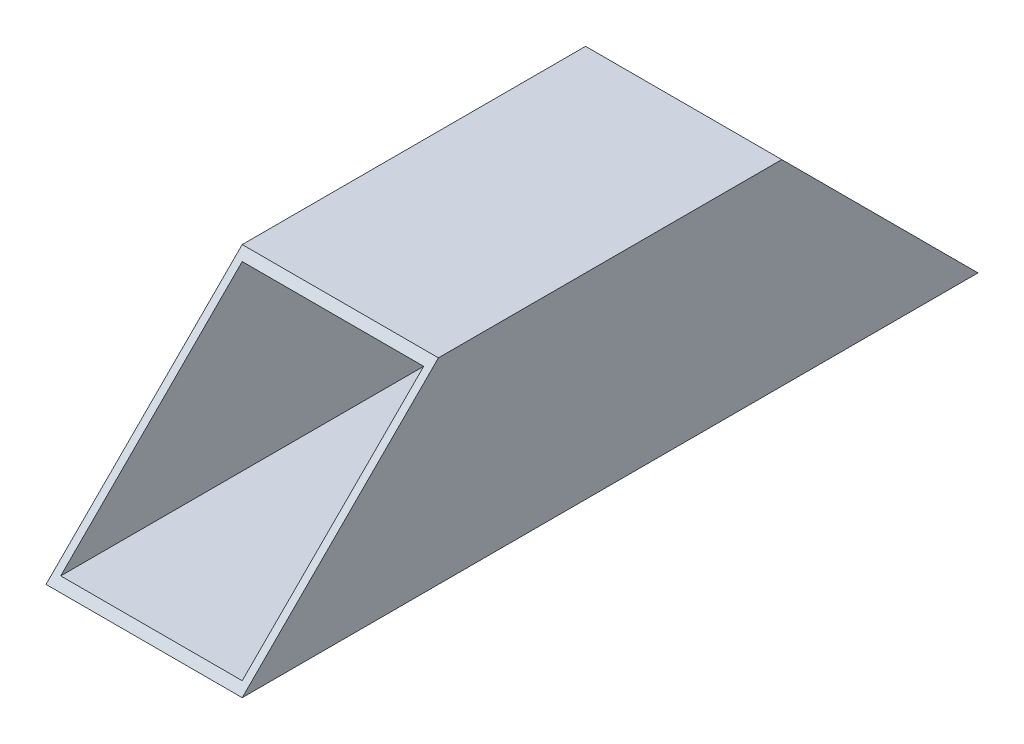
ISO-10303-21;
HEADER;
FILE_DESCRIPTION(('STEP AP214'),'2;1');
FILE_NAME('part.step','',(''),(''),'','','');
FILE_SCHEMA(('AUTOMOTIVE_DESIGN { 1 0 10303 214 1 1 1 1 }'));
ENDSEC;
DATA;
#1=APPLICATION_CONTEXT('core data for automotive mechanical design processes');
#2=APPLICATION_PROTOCOL_DEFINITION('international standard','automotive_design',2000,#1);
#3=PRODUCT_CONTEXT('',#1,'mechanical');
#4=PRODUCT('Part','Part','',(#3));
#5=PRODUCT_RELATED_PRODUCT_CATEGORY('part','',(#4));
#6=PRODUCT_DEFINITION_FORMATION('','',#4);
#7=PRODUCT_DEFINITION_CONTEXT('part definition',#1,'design');
#8=PRODUCT_DEFINITION('design','',#6,#7);
#9=PRODUCT_DEFINITION_SHAPE('','',#8);
#10=(LENGTH_UNIT() NAMED_UNIT(*) SI_UNIT(.MILLI.,.METRE.));
#11=(NAMED_UNIT(*) PLANE_ANGLE_UNIT() SI_UNIT($,.RADIAN.));
#12=(NAMED_UNIT(*) SI_UNIT($,.STERADIAN.) SOLID_ANGLE_UNIT());
#13=UNCERTAINTY_MEASURE_WITH_UNIT(LENGTH_MEASURE(1.E-05),#10,'distance_accuracy_value','');
#14=(GEOMETRIC_REPRESENTATION_CONTEXT(3) GLOBAL_UNCERTAINTY_ASSIGNED_CONTEXT((#13)) GLOBAL_UNIT_ASSIGNED_CONTEXT((#10,
#11,#12)) REPRESENTATION_CONTEXT('',''));
#15=CARTESIAN_POINT('',(0.,0.,0.));
#16=DIRECTION('',(0.,0.,1.));
#17=DIRECTION('',(1.,0.,0.));
#18=AXIS2_PLACEMENT_3D('',#15,#16,#17);
#19=CARTESIAN_POINT('',(0.,80.,300.));
#20=DIRECTION('',(1.,0.,0.));
#21=DIRECTION('',(0.,1.,0.));
#22=AXIS2_PLACEMENT_3D('',#19,#20,#21);
#23=PLANE('',#22);
#24=DIRECTION('',(0.,0.,-1.));
#25=VECTOR('',#24,1.);
#26=CARTESIAN_POINT('',(0.,80.,300.));
#27=LINE('',#26,#25);
#28=CARTESIAN_POINT('',(0.,80.,220.));
#29=VERTEX_POINT('',#28);
#30=CARTESIAN_POINT('',(0.,80.,80.0000000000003));
#31=VERTEX_POINT('',#30);
#32=EDGE_CURVE('E123',#29,#31,#27,.T.);
#33=ORIENTED_EDGE('',*,*,#32,.T.);
#34=DIRECTION('',(0.,0.707106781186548,0.707106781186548));
#35=VECTOR('',#34,1.);
#36=CARTESIAN_POINT('',(0.,80.,80.0000000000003));
#37=LINE('',#36,#35);
#38=CARTESIAN_POINT('',(0.,0.,0.));
#39=VERTEX_POINT('',#38);
#40=EDGE_CURVE('E42',#31,#39,#37,.F.);
#41=ORIENTED_EDGE('',*,*,#40,.T.);
#42=DIRECTION('',(0.,0.,-1.));
#43=VECTOR('',#42,1.);
#44=CARTESIAN_POINT('',(0.,0.,300.));
#45=LINE('',#44,#43);
#46=CARTESIAN_POINT('',(0.,0.,300.));
#47=VERTEX_POINT('',#46);
#48=EDGE_CURVE('E130',#47,#39,#45,.T.);
#49=ORIENTED_EDGE('',*,*,#48,.F.);
#50=DIRECTION('',(0.,0.707106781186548,-0.707106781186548));
#51=VECTOR('',#50,1.);
#52=CARTESIAN_POINT('',(0.,-2.35922392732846E-13,300.));
#53=LINE('',#52,#51);
#54=EDGE_CURVE('E133',#47,#29,#53,.T.);
#55=ORIENTED_EDGE('',*,*,#54,.T.);
#56=EDGE_LOOP('',(#33,#41,#49,#55));
#57=FACE_BOUND('',#56,.T.);
#58=ADVANCED_FACE('F32',(#57),#23,.F.);
#59=CARTESIAN_POINT('',(0.,0.,300.));
#60=DIRECTION('',(0.,1.,0.));
#61=DIRECTION('',(0.,0.,1.));
#62=AXIS2_PLACEMENT_3D('',#59,#60,#61);
#63=PLANE('',#62);
#64=DIRECTION('',(1.,0.,0.));
#65=VECTOR('',#64,1.);
#66=CARTESIAN_POINT('',(0.,0.,0.));
#67=LINE('',#66,#65);
#68=CARTESIAN_POINT('',(80.,0.,0.));
#69=VERTEX_POINT('',#68);
#70=EDGE_CURVE('E90',#39,#69,#67,.T.);
#71=ORIENTED_EDGE('',*,*,#70,.T.);
#72=DIRECTION('',(0.,0.,-1.));
#73=VECTOR('',#72,1.);
#74=CARTESIAN_POINT('',(80.,0.,300.));
#75=LINE('',#74,#73);
#76=CARTESIAN_POINT('',(80.,0.,300.));
#77=VERTEX_POINT('',#76);
#78=EDGE_CURVE('E128',#77,#69,#75,.T.);
#79=ORIENTED_EDGE('',*,*,#78,.F.);
#80=DIRECTION('',(1.,0.,0.));
#81=VECTOR('',#80,1.);
#82=CARTESIAN_POINT('',(0.,0.,300.));
#83=LINE('',#82,#81);
#84=EDGE_CURVE('E120',#47,#77,#83,.T.);
#85=ORIENTED_EDGE('',*,*,#84,.F.);
#86=ORIENTED_EDGE('',*,*,#48,.T.);
#87=EDGE_LOOP('',(#71,#79,#85,#86));
#88=FACE_BOUND('',#87,.T.);
#89=ADVANCED_FACE('F161',(#88),#63,.F.);
#90=CARTESIAN_POINT('',(80.,80.,300.));
#91=DIRECTION('',(-1.,0.,0.));
#92=DIRECTION('',(0.,-1.,0.));
#93=AXIS2_PLACEMENT_3D('',#90,#91,#92);
#94=PLANE('',#93);
#95=ORIENTED_EDGE('',*,*,#78,.T.);
#96=DIRECTION('',(0.,-0.707106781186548,-0.707106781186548));
#97=VECTOR('',#96,1.);
#98=CARTESIAN_POINT('',(80.,80.,80.0000000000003));
#99=LINE('',#98,#97);
#100=CARTESIAN_POINT('',(80.,80.,80.0000000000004));
#101=VERTEX_POINT('',#100);
#102=EDGE_CURVE('E11',#69,#101,#99,.F.);
#103=ORIENTED_EDGE('',*,*,#102,.T.);
#104=DIRECTION('',(0.,0.,-1.));
#105=VECTOR('',#104,1.);
#106=CARTESIAN_POINT('',(80.,80.,300.));
#107=LINE('',#106,#105);
#108=CARTESIAN_POINT('',(80.,80.,220.));
#109=VERTEX_POINT('',#108);
#110=EDGE_CURVE('E126',#109,#101,#107,.T.);
#111=ORIENTED_EDGE('',*,*,#110,.F.);
#112=DIRECTION('',(0.,-0.707106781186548,0.707106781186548));
#113=VECTOR('',#112,1.);
#114=CARTESIAN_POINT('',(80.,-2.42861286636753E-13,300.));
#115=LINE('',#114,#113);
#116=EDGE_CURVE('E139',#109,#77,#115,.T.);
#117=ORIENTED_EDGE('',*,*,#116,.T.);
#118=EDGE_LOOP('',(#95,#103,#111,#117));
#119=FACE_BOUND('',#118,.T.);
#120=ADVANCED_FACE('F188',(#119),#94,.F.);
#121=CARTESIAN_POINT('',(0.,80.,300.));
#122=DIRECTION('',(0.,-1.,0.));
#123=DIRECTION('',(0.,0.,-1.));
#124=AXIS2_PLACEMENT_3D('',#121,#122,#123);
#125=PLANE('',#124);
#126=ORIENTED_EDGE('',*,*,#110,.T.);
#127=DIRECTION('',(-1.,0.,0.));
#128=VECTOR('',#127,1.);
#129=CARTESIAN_POINT('',(0.,80.,80.0000000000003));
#130=LINE('',#129,#128);
#131=EDGE_CURVE('E142',#101,#31,#130,.T.);
#132=ORIENTED_EDGE('',*,*,#131,.T.);
#133=ORIENTED_EDGE('',*,*,#32,.F.);
#134=DIRECTION('',(1.,0.,0.));
#135=VECTOR('',#134,1.);
#136=CARTESIAN_POINT('',(80.,80.,220.));
#137=LINE('',#136,#135);
#138=EDGE_CURVE('E136',#29,#109,#137,.T.);
#139=ORIENTED_EDGE('',*,*,#138,.T.);
#140=EDGE_LOOP('',(#126,#132,#133,#139));
#141=FACE_BOUND('',#140,.T.);
#142=ADVANCED_FACE('F193',(#141),#125,.F.);
#143=CARTESIAN_POINT('',(3.,77.,300.));
#144=DIRECTION('',(1.,0.,0.));
#145=DIRECTION('',(0.,1.,0.));
#146=AXIS2_PLACEMENT_3D('',#143,#144,#145);
#147=PLANE('',#146);
#148=DIRECTION('',(0.,0.707106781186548,0.707106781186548));
#149=VECTOR('',#148,1.);
#150=CARTESIAN_POINT('',(2.99999999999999,80.,80.0000000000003));
#151=LINE('',#150,#149);
#152=CARTESIAN_POINT('',(3.,77.,77.0000000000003));
#153=VERTEX_POINT('',#152);
#154=CARTESIAN_POINT('',(3.,3.,3.00000000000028));
#155=VERTEX_POINT('',#154);
#156=EDGE_CURVE('E82',#153,#155,#151,.F.);
#157=ORIENTED_EDGE('',*,*,#156,.F.);
#158=DIRECTION('',(0.,0.,-1.));
#159=VECTOR('',#158,1.);
#160=CARTESIAN_POINT('',(3.,77.,300.));
#161=LINE('',#160,#159);
#162=CARTESIAN_POINT('',(3.,77.,223.));
#163=VERTEX_POINT('',#162);
#164=EDGE_CURVE('E109',#163,#153,#161,.T.);
#165=ORIENTED_EDGE('',*,*,#164,.F.);
#166=DIRECTION('',(0.,-0.707106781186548,0.707106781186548));
#167=VECTOR('',#166,1.);
#168=CARTESIAN_POINT('',(3.,38.4999999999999,261.5));
#169=LINE('',#168,#167);
#170=CARTESIAN_POINT('',(3.,3.,297.));
#171=VERTEX_POINT('',#170);
#172=EDGE_CURVE('E89',#163,#171,#169,.T.);
#173=ORIENTED_EDGE('',*,*,#172,.T.);
#174=DIRECTION('',(0.,0.,-1.));
#175=VECTOR('',#174,1.);
#176=CARTESIAN_POINT('',(3.,3.,300.));
#177=LINE('',#176,#175);
#178=EDGE_CURVE('E76',#171,#155,#177,.T.);
#179=ORIENTED_EDGE('',*,*,#178,.T.);
#180=EDGE_LOOP('',(#157,#165,#173,#179));
#181=FACE_BOUND('',#180,.T.);
#182=ADVANCED_FACE('F85',(#181),#147,.T.);
#183=CARTESIAN_POINT('',(3.,3.,300.));
#184=DIRECTION('',(0.,1.,0.));
#185=DIRECTION('',(0.,0.,1.));
#186=AXIS2_PLACEMENT_3D('',#183,#184,#185);
#187=PLANE('',#186);
#188=DIRECTION('',(-1.,0.,0.));
#189=VECTOR('',#188,1.);
#190=CARTESIAN_POINT('',(0.,3.,3.00000000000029));
#191=LINE('',#190,#189);
#192=CARTESIAN_POINT('',(77.,3.,3.00000000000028));
#193=VERTEX_POINT('',#192);
#194=EDGE_CURVE('E36',#155,#193,#191,.F.);
#195=ORIENTED_EDGE('',*,*,#194,.F.);
#196=ORIENTED_EDGE('',*,*,#178,.F.);
#197=DIRECTION('',(1.,0.,0.));
#198=VECTOR('',#197,1.);
#199=CARTESIAN_POINT('',(3.,3.,297.));
#200=LINE('',#199,#198);
#201=CARTESIAN_POINT('',(77.,3.,297.));
#202=VERTEX_POINT('',#201);
#203=EDGE_CURVE('E143',#171,#202,#200,.T.);
#204=ORIENTED_EDGE('',*,*,#203,.T.);
#205=DIRECTION('',(0.,0.,-1.));
#206=VECTOR('',#205,1.);
#207=CARTESIAN_POINT('',(77.,3.,300.));
#208=LINE('',#207,#206);
#209=EDGE_CURVE('E70',#202,#193,#208,.T.);
#210=ORIENTED_EDGE('',*,*,#209,.T.);
#211=EDGE_LOOP('',(#195,#196,#204,#210));
#212=FACE_BOUND('',#211,.T.);
#213=ADVANCED_FACE('F75',(#212),#187,.T.);
#214=CARTESIAN_POINT('',(77.,77.,300.));
#215=DIRECTION('',(-1.,0.,0.));
#216=DIRECTION('',(0.,-1.,0.));
#217=AXIS2_PLACEMENT_3D('',#214,#215,#216);
#218=PLANE('',#217);
#219=DIRECTION('',(0.,-0.707106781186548,-0.707106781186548));
#220=VECTOR('',#219,1.);
#221=CARTESIAN_POINT('',(77.,80.,80.0000000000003));
#222=LINE('',#221,#220);
#223=CARTESIAN_POINT('',(77.,77.,77.0000000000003));
#224=VERTEX_POINT('',#223);
#225=EDGE_CURVE('E81',#193,#224,#222,.F.);
#226=ORIENTED_EDGE('',*,*,#225,.F.);
#227=ORIENTED_EDGE('',*,*,#209,.F.);
#228=DIRECTION('',(0.,0.707106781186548,-0.707106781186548));
#229=VECTOR('',#228,1.);
#230=CARTESIAN_POINT('',(77.,38.4999999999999,261.5));
#231=LINE('',#230,#229);
#232=CARTESIAN_POINT('',(77.,77.,223.));
#233=VERTEX_POINT('',#232);
#234=EDGE_CURVE('E105',#202,#233,#231,.T.);
#235=ORIENTED_EDGE('',*,*,#234,.T.);
#236=DIRECTION('',(0.,0.,-1.));
#237=VECTOR('',#236,1.);
#238=CARTESIAN_POINT('',(77.,77.,300.));
#239=LINE('',#238,#237);
#240=EDGE_CURVE('E104',#233,#224,#239,.T.);
#241=ORIENTED_EDGE('',*,*,#240,.T.);
#242=EDGE_LOOP('',(#226,#227,#235,#241));
#243=FACE_BOUND('',#242,.T.);
#244=ADVANCED_FACE('F99',(#243),#218,.T.);
#245=CARTESIAN_POINT('',(3.,77.,300.));
#246=DIRECTION('',(0.,-1.,0.));
#247=DIRECTION('',(0.,0.,-1.));
#248=AXIS2_PLACEMENT_3D('',#245,#246,#247);
#249=PLANE('',#248);
#250=DIRECTION('',(1.,0.,0.));
#251=VECTOR('',#250,1.);
#252=CARTESIAN_POINT('',(0.,77.,77.0000000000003));
#253=LINE('',#252,#251);
#254=EDGE_CURVE('E94',#224,#153,#253,.F.);
#255=ORIENTED_EDGE('',*,*,#254,.F.);
#256=ORIENTED_EDGE('',*,*,#240,.F.);
#257=DIRECTION('',(-1.,0.,0.));
#258=VECTOR('',#257,1.);
#259=CARTESIAN_POINT('',(3.,77.,223.));
#260=LINE('',#259,#258);
#261=EDGE_CURVE('E113',#233,#163,#260,.T.);
#262=ORIENTED_EDGE('',*,*,#261,.T.);
#263=ORIENTED_EDGE('',*,*,#164,.T.);
#264=EDGE_LOOP('',(#255,#256,#262,#263));
#265=FACE_BOUND('',#264,.T.);
#266=ADVANCED_FACE('F111',(#265),#249,.T.);
#267=CARTESIAN_POINT('',(0.,-2.35922392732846E-13,300.));
#268=DIRECTION('',(0.,0.707106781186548,0.707106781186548));
#269=DIRECTION('',(0.,-0.707106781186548,0.707106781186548));
#270=AXIS2_PLACEMENT_3D('',#267,#268,#269);
#271=PLANE('',#270);
#272=ORIENTED_EDGE('',*,*,#116,.F.);
#273=ORIENTED_EDGE('',*,*,#138,.F.);
#274=ORIENTED_EDGE('',*,*,#54,.F.);
#275=ORIENTED_EDGE('',*,*,#84,.T.);
#276=EDGE_LOOP('',(#272,#273,#274,#275));
#277=FACE_BOUND('',#276,.T.);
#278=ORIENTED_EDGE('',*,*,#203,.F.);
#279=ORIENTED_EDGE('',*,*,#172,.F.);
#280=ORIENTED_EDGE('',*,*,#261,.F.);
#281=ORIENTED_EDGE('',*,*,#234,.F.);
#282=EDGE_LOOP('',(#278,#279,#280,#281));
#283=FACE_BOUND('',#282,.T.);
#284=ADVANCED_FACE('F174',(#277,#283),#271,.T.);
#285=CARTESIAN_POINT('',(0.,80.,80.0000000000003));
#286=DIRECTION('',(0.,-0.707106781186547,0.707106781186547));
#287=DIRECTION('',(0.,-0.707106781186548,-0.707106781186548));
#288=AXIS2_PLACEMENT_3D('',#285,#286,#287);
#289=PLANE('',#288);
#290=ORIENTED_EDGE('',*,*,#102,.F.);
#291=ORIENTED_EDGE('',*,*,#70,.F.);
#292=ORIENTED_EDGE('',*,*,#40,.F.);
#293=ORIENTED_EDGE('',*,*,#131,.F.);
#294=EDGE_LOOP('',(#290,#291,#292,#293));
#295=FACE_BOUND('',#294,.T.);
#296=ORIENTED_EDGE('',*,*,#156,.T.);
#297=ORIENTED_EDGE('',*,*,#194,.T.);
#298=ORIENTED_EDGE('',*,*,#225,.T.);
#299=ORIENTED_EDGE('',*,*,#254,.T.);
#300=EDGE_LOOP('',(#296,#297,#298,#299));
#301=FACE_BOUND('',#300,.T.);
#302=ADVANCED_FACE('F34',(#295,#301),#289,.F.);
#303=CLOSED_SHELL('',(#58,#89,#120,#142,#182,#213,#244,#266,#284,#302));
#304=MANIFOLD_SOLID_BREP('B2',#303);
#305=ADVANCED_BREP_SHAPE_REPRESENTATION('',(#18,#304),#14);
#306=SHAPE_DEFINITION_REPRESENTATION(#9,#305);
ENDSEC;
END-ISO-10303-21;
